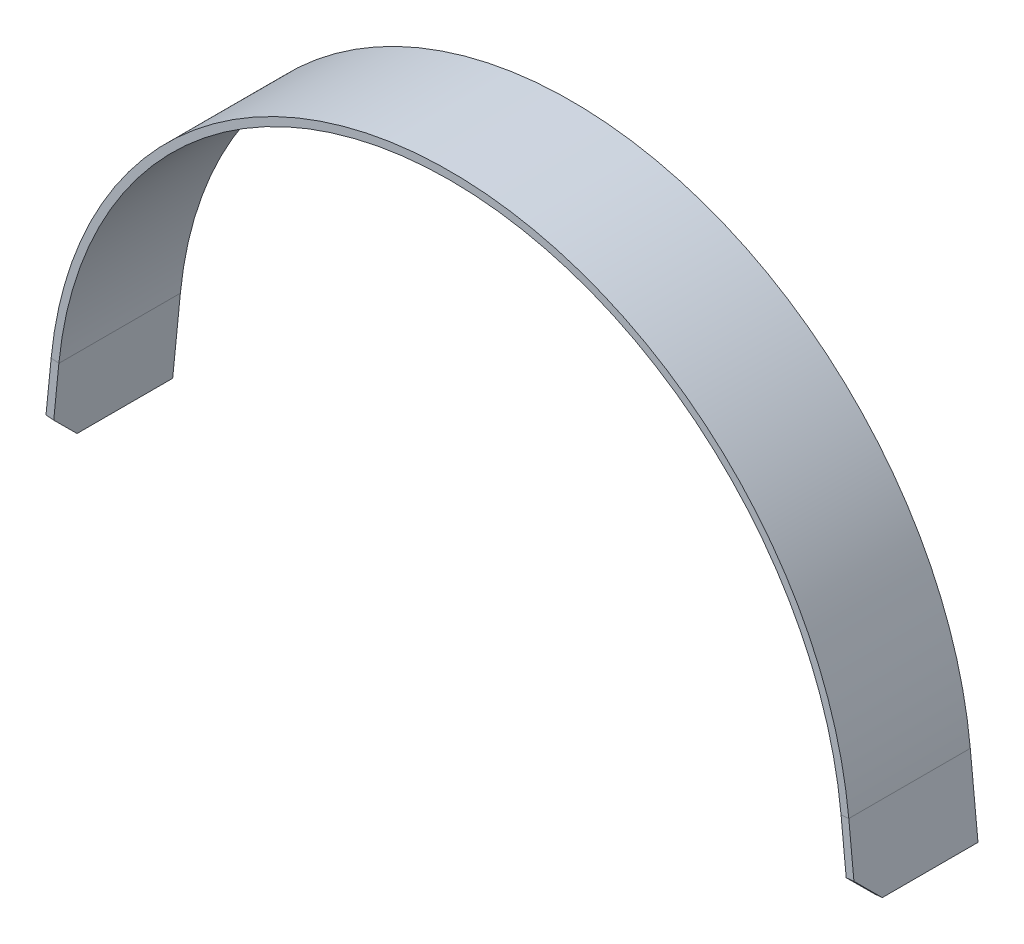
ISO-10303-21;
HEADER;
FILE_DESCRIPTION(('STEP AP214'),'2;1');
FILE_NAME('part.step','',(''),(''),'','','');
FILE_SCHEMA(('AUTOMOTIVE_DESIGN { 1 0 10303 214 1 1 1 1 }'));
ENDSEC;
DATA;
#1=APPLICATION_CONTEXT('core data for automotive mechanical design processes');
#2=APPLICATION_PROTOCOL_DEFINITION('international standard','automotive_design',2000,#1);
#3=PRODUCT_CONTEXT('',#1,'mechanical');
#4=PRODUCT('Part','Part','',(#3));
#5=PRODUCT_RELATED_PRODUCT_CATEGORY('part','',(#4));
#6=PRODUCT_DEFINITION_FORMATION('','',#4);
#7=PRODUCT_DEFINITION_CONTEXT('part definition',#1,'design');
#8=PRODUCT_DEFINITION('design','',#6,#7);
#9=PRODUCT_DEFINITION_SHAPE('','',#8);
#10=(LENGTH_UNIT() NAMED_UNIT(*) SI_UNIT(.MILLI.,.METRE.));
#11=(NAMED_UNIT(*) PLANE_ANGLE_UNIT() SI_UNIT($,.RADIAN.));
#12=(NAMED_UNIT(*) SI_UNIT($,.STERADIAN.) SOLID_ANGLE_UNIT());
#13=UNCERTAINTY_MEASURE_WITH_UNIT(LENGTH_MEASURE(1.E-05),#10,'distance_accuracy_value','');
#14=(GEOMETRIC_REPRESENTATION_CONTEXT(3) GLOBAL_UNCERTAINTY_ASSIGNED_CONTEXT((#13)) GLOBAL_UNIT_ASSIGNED_CONTEXT((#10,
#11,#12)) REPRESENTATION_CONTEXT('',''));
#15=CARTESIAN_POINT('',(0.,0.,0.));
#16=DIRECTION('',(0.,0.,1.));
#17=DIRECTION('',(1.,0.,0.));
#18=AXIS2_PLACEMENT_3D('',#15,#16,#17);
#19=CARTESIAN_POINT('',(-151.25805763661,15.,47.));
#20=DIRECTION('',(0.,0.,1.));
#21=DIRECTION('',(1.,0.,0.));
#22=AXIS2_PLACEMENT_3D('',#19,#20,#21);
#23=PLANE('',#22);
#24=DIRECTION('',(-0.995118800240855,0.0986842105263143,0.));
#25=VECTOR('',#24,1.);
#26=CARTESIAN_POINT('',(-151.25805763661,15.,47.));
#27=LINE('',#26,#25);
#28=CARTESIAN_POINT('',(-151.25805763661,15.,47.));
#29=VERTEX_POINT('',#28);
#30=CARTESIAN_POINT('',(-154.243414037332,15.2960526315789,47.));
#31=VERTEX_POINT('',#30);
#32=EDGE_CURVE('E121',#29,#31,#27,.T.);
#33=ORIENTED_EDGE('',*,*,#32,.F.);
#34=CARTESIAN_POINT('',(0.,0.,47.));
#35=DIRECTION('',(0.,0.,-1.));
#36=DIRECTION('',(-1.,0.,0.));
#37=AXIS2_PLACEMENT_3D('',#34,#35,#36);
#38=CIRCLE('',#37,152.);
#39=CARTESIAN_POINT('',(151.25805763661,15.,47.));
#40=VERTEX_POINT('',#39);
#41=EDGE_CURVE('E119',#29,#40,#38,.T.);
#42=ORIENTED_EDGE('',*,*,#41,.T.);
#43=DIRECTION('',(-0.995118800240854,-0.0986842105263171,0.));
#44=VECTOR('',#43,1.);
#45=CARTESIAN_POINT('',(154.243414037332,15.2960526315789,47.));
#46=LINE('',#45,#44);
#47=CARTESIAN_POINT('',(154.243414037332,15.2960526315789,47.));
#48=VERTEX_POINT('',#47);
#49=EDGE_CURVE('E113',#48,#40,#46,.T.);
#50=ORIENTED_EDGE('',*,*,#49,.F.);
#51=CARTESIAN_POINT('',(0.,0.,47.));
#52=DIRECTION('',(0.,0.,1.));
#53=DIRECTION('',(1.,0.,0.));
#54=AXIS2_PLACEMENT_3D('',#51,#52,#53);
#55=CIRCLE('',#54,155.);
#56=EDGE_CURVE('E117',#31,#48,#55,.F.);
#57=ORIENTED_EDGE('',*,*,#56,.F.);
#58=EDGE_LOOP('',(#33,#42,#50,#57));
#59=FACE_BOUND('',#58,.T.);
#60=ADVANCED_FACE('F36',(#59),#23,.T.);
#61=CARTESIAN_POINT('',(154.243414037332,15.2960526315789,47.));
#62=DIRECTION('',(0.,0.,1.));
#63=DIRECTION('',(1.,0.,0.));
#64=AXIS2_PLACEMENT_3D('',#61,#62,#63);
#65=PLANE('',#64);
#66=DIRECTION('',(0.0986842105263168,0.995118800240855,0.));
#67=VECTOR('',#66,1.);
#68=CARTESIAN_POINT('',(-154.243414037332,15.296052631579,47.));
#69=LINE('',#68,#67);
#70=CARTESIAN_POINT('',(-156.231620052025,-4.75275936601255,47.));
#71=VERTEX_POINT('',#70);
#72=EDGE_CURVE('E145',#71,#31,#69,.T.);
#73=ORIENTED_EDGE('',*,*,#72,.F.);
#74=DIRECTION('',(0.995118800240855,-0.0986842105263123,0.));
#75=VECTOR('',#74,1.);
#76=CARTESIAN_POINT('',(149.25098640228,-35.0469411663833,47.));
#77=LINE('',#76,#75);
#78=CARTESIAN_POINT('',(-153.246263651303,-5.04881199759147,47.));
#79=VERTEX_POINT('',#78);
#80=EDGE_CURVE('E198',#71,#79,#77,.T.);
#81=ORIENTED_EDGE('',*,*,#80,.T.);
#82=DIRECTION('',(0.0986842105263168,0.995118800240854,0.));
#83=VECTOR('',#82,1.);
#84=CARTESIAN_POINT('',(-151.25805763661,15.,47.));
#85=LINE('',#84,#83);
#86=EDGE_CURVE('E147',#79,#29,#85,.T.);
#87=ORIENTED_EDGE('',*,*,#86,.T.);
#88=ORIENTED_EDGE('',*,*,#32,.T.);
#89=EDGE_LOOP('',(#73,#81,#87,#88));
#90=FACE_BOUND('',#89,.T.);
#91=ADVANCED_FACE('F240',(#90),#65,.T.);
#92=CARTESIAN_POINT('',(151.25805763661,15.,0.));
#93=DIRECTION('',(0.,0.,-1.));
#94=DIRECTION('',(-1.,0.,0.));
#95=AXIS2_PLACEMENT_3D('',#92,#93,#94);
#96=PLANE('',#95);
#97=DIRECTION('',(0.995118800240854,0.0986842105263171,0.));
#98=VECTOR('',#97,1.);
#99=CARTESIAN_POINT('',(151.25805763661,15.,0.));
#100=LINE('',#99,#98);
#101=CARTESIAN_POINT('',(151.25805763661,15.,0.));
#102=VERTEX_POINT('',#101);
#103=CARTESIAN_POINT('',(154.243414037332,15.2960526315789,0.));
#104=VERTEX_POINT('',#103);
#105=EDGE_CURVE('E122',#102,#104,#100,.T.);
#106=ORIENTED_EDGE('',*,*,#105,.F.);
#107=CARTESIAN_POINT('',(0.,0.,0.));
#108=DIRECTION('',(0.,0.,-1.));
#109=DIRECTION('',(-1.,0.,0.));
#110=AXIS2_PLACEMENT_3D('',#107,#108,#109);
#111=CIRCLE('',#110,152.);
#112=CARTESIAN_POINT('',(-151.25805763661,15.,0.));
#113=VERTEX_POINT('',#112);
#114=EDGE_CURVE('E172',#113,#102,#111,.T.);
#115=ORIENTED_EDGE('',*,*,#114,.F.);
#116=DIRECTION('',(0.995118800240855,-0.0986842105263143,0.));
#117=VECTOR('',#116,1.);
#118=CARTESIAN_POINT('',(-154.243414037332,15.2960526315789,0.));
#119=LINE('',#118,#117);
#120=CARTESIAN_POINT('',(-154.243414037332,15.2960526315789,0.));
#121=VERTEX_POINT('',#120);
#122=EDGE_CURVE('E188',#121,#113,#119,.T.);
#123=ORIENTED_EDGE('',*,*,#122,.F.);
#124=CARTESIAN_POINT('',(0.,0.,0.));
#125=DIRECTION('',(0.,0.,1.));
#126=DIRECTION('',(1.,0.,0.));
#127=AXIS2_PLACEMENT_3D('',#124,#125,#126);
#128=CIRCLE('',#127,155.);
#129=EDGE_CURVE('E161',#121,#104,#128,.F.);
#130=ORIENTED_EDGE('',*,*,#129,.T.);
#131=EDGE_LOOP('',(#106,#115,#123,#130));
#132=FACE_BOUND('',#131,.T.);
#133=ADVANCED_FACE('F217',(#132),#96,.T.);
#134=CARTESIAN_POINT('',(-154.243414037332,15.2960526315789,0.));
#135=DIRECTION('',(0.,0.,-1.));
#136=DIRECTION('',(-1.,0.,0.));
#137=AXIS2_PLACEMENT_3D('',#134,#135,#136);
#138=PLANE('',#137);
#139=DIRECTION('',(0.0986842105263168,-0.995118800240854,0.));
#140=VECTOR('',#139,1.);
#141=CARTESIAN_POINT('',(151.25805763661,15.,0.));
#142=LINE('',#141,#140);
#143=CARTESIAN_POINT('',(154.233105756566,-15.,0.));
#144=VERTEX_POINT('',#143);
#145=EDGE_CURVE('E154',#102,#144,#142,.T.);
#146=ORIENTED_EDGE('',*,*,#145,.F.);
#147=ORIENTED_EDGE('',*,*,#105,.T.);
#148=DIRECTION('',(0.0986842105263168,-0.995118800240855,0.));
#149=VECTOR('',#148,1.);
#150=CARTESIAN_POINT('',(154.243414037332,15.296052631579,0.));
#151=LINE('',#150,#149);
#152=CARTESIAN_POINT('',(157.218462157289,-14.7039473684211,0.));
#153=VERTEX_POINT('',#152);
#154=EDGE_CURVE('E132',#104,#153,#151,.T.);
#155=ORIENTED_EDGE('',*,*,#154,.T.);
#156=DIRECTION('',(-0.995118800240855,-0.0986842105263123,0.));
#157=VECTOR('',#156,1.);
#158=CARTESIAN_POINT('',(157.218462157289,-14.7039473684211,0.));
#159=LINE('',#158,#157);
#160=EDGE_CURVE('E157',#153,#144,#159,.T.);
#161=ORIENTED_EDGE('',*,*,#160,.T.);
#162=EDGE_LOOP('',(#146,#147,#155,#161));
#163=FACE_BOUND('',#162,.T.);
#164=ADVANCED_FACE('F214',(#163),#138,.T.);
#165=CARTESIAN_POINT('',(151.25805763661,15.,47.));
#166=DIRECTION('',(0.995118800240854,0.0986842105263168,0.));
#167=DIRECTION('',(-0.0986842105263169,0.995118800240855,0.));
#168=AXIS2_PLACEMENT_3D('',#165,#166,#167);
#169=PLANE('',#168);
#170=DIRECTION('',(0.,0.,-1.));
#171=VECTOR('',#170,1.);
#172=CARTESIAN_POINT('',(154.233105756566,-15.,47.));
#173=LINE('',#172,#171);
#174=CARTESIAN_POINT('',(154.233105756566,-15.,37.0000000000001));
#175=VERTEX_POINT('',#174);
#176=EDGE_CURVE('E186',#175,#144,#173,.T.);
#177=ORIENTED_EDGE('',*,*,#176,.F.);
#178=DIRECTION('',(0.0697802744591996,-0.70365525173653,-0.707106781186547));
#179=VECTOR('',#178,1.);
#180=CARTESIAN_POINT('',(154.233105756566,-15.,37.0000000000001));
#181=LINE('',#180,#179);
#182=CARTESIAN_POINT('',(153.246263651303,-5.04881199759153,47.));
#183=VERTEX_POINT('',#182);
#184=EDGE_CURVE('E58',#175,#183,#181,.F.);
#185=ORIENTED_EDGE('',*,*,#184,.T.);
#186=DIRECTION('',(0.0986842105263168,-0.995118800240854,0.));
#187=VECTOR('',#186,1.);
#188=CARTESIAN_POINT('',(151.25805763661,15.,47.));
#189=LINE('',#188,#187);
#190=EDGE_CURVE('E140',#40,#183,#189,.T.);
#191=ORIENTED_EDGE('',*,*,#190,.F.);
#192=DIRECTION('',(0.,0.,-1.));
#193=VECTOR('',#192,1.);
#194=CARTESIAN_POINT('',(151.25805763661,15.,47.));
#195=LINE('',#194,#193);
#196=EDGE_CURVE('E153',#40,#102,#195,.T.);
#197=ORIENTED_EDGE('',*,*,#196,.T.);
#198=ORIENTED_EDGE('',*,*,#145,.T.);
#199=EDGE_LOOP('',(#177,#185,#191,#197,#198));
#200=FACE_BOUND('',#199,.T.);
#201=ADVANCED_FACE('F211',(#200),#169,.F.);
#202=CARTESIAN_POINT('',(157.218462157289,-14.7039473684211,47.));
#203=DIRECTION('',(0.0986842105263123,-0.995118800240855,0.));
#204=DIRECTION('',(0.995118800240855,0.0986842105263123,0.));
#205=AXIS2_PLACEMENT_3D('',#202,#203,#204);
#206=PLANE('',#205);
#207=DIRECTION('',(0.,0.,-1.));
#208=VECTOR('',#207,1.);
#209=CARTESIAN_POINT('',(157.218462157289,-14.7039473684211,47.));
#210=LINE('',#209,#208);
#211=CARTESIAN_POINT('',(157.218462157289,-14.7039473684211,37.0000000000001));
#212=VERTEX_POINT('',#211);
#213=EDGE_CURVE('E136',#212,#153,#210,.T.);
#214=ORIENTED_EDGE('',*,*,#213,.F.);
#215=DIRECTION('',(-0.995118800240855,-0.0986842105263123,0.));
#216=VECTOR('',#215,1.);
#217=CARTESIAN_POINT('',(157.218462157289,-14.7039473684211,37.0000000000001));
#218=LINE('',#217,#216);
#219=EDGE_CURVE('E202',#212,#175,#218,.T.);
#220=ORIENTED_EDGE('',*,*,#219,.T.);
#221=ORIENTED_EDGE('',*,*,#176,.T.);
#222=ORIENTED_EDGE('',*,*,#160,.F.);
#223=EDGE_LOOP('',(#214,#220,#221,#222));
#224=FACE_BOUND('',#223,.T.);
#225=ADVANCED_FACE('F208',(#224),#206,.T.);
#226=CARTESIAN_POINT('',(154.243414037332,15.296052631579,47.));
#227=DIRECTION('',(0.995118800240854,0.0986842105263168,0.));
#228=DIRECTION('',(-0.0986842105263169,0.995118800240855,0.));
#229=AXIS2_PLACEMENT_3D('',#226,#227,#228);
#230=PLANE('',#229);
#231=DIRECTION('',(0.0986842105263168,-0.995118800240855,0.));
#232=VECTOR('',#231,1.);
#233=CARTESIAN_POINT('',(154.243414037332,15.296052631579,47.));
#234=LINE('',#233,#232);
#235=CARTESIAN_POINT('',(156.231620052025,-4.7527593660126,47.));
#236=VERTEX_POINT('',#235);
#237=EDGE_CURVE('E129',#48,#236,#234,.T.);
#238=ORIENTED_EDGE('',*,*,#237,.T.);
#239=DIRECTION('',(-0.0697802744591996,0.70365525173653,0.707106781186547));
#240=VECTOR('',#239,1.);
#241=CARTESIAN_POINT('',(155.237517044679,5.2716466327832,57.0735771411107));
#242=LINE('',#241,#240);
#243=EDGE_CURVE('E11',#236,#212,#242,.F.);
#244=ORIENTED_EDGE('',*,*,#243,.T.);
#245=ORIENTED_EDGE('',*,*,#213,.T.);
#246=ORIENTED_EDGE('',*,*,#154,.F.);
#247=DIRECTION('',(0.,0.,-1.));
#248=VECTOR('',#247,1.);
#249=CARTESIAN_POINT('',(154.243414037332,15.2960526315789,47.));
#250=LINE('',#249,#248);
#251=EDGE_CURVE('E127',#48,#104,#250,.T.);
#252=ORIENTED_EDGE('',*,*,#251,.F.);
#253=EDGE_LOOP('',(#238,#244,#245,#246,#252));
#254=FACE_BOUND('',#253,.T.);
#255=ADVANCED_FACE('F128',(#254),#230,.T.);
#256=CARTESIAN_POINT('',(0.,0.,47.));
#257=DIRECTION('',(0.,0.,-1.));
#258=DIRECTION('',(-1.,0.,0.));
#259=AXIS2_PLACEMENT_3D('',#256,#257,#258);
#260=CYLINDRICAL_SURFACE('',#259,155.);
#261=ORIENTED_EDGE('',*,*,#129,.F.);
#262=DIRECTION('',(0.,0.,-1.));
#263=VECTOR('',#262,1.);
#264=CARTESIAN_POINT('',(-154.243414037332,15.2960526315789,47.));
#265=LINE('',#264,#263);
#266=EDGE_CURVE('E137',#31,#121,#265,.T.);
#267=ORIENTED_EDGE('',*,*,#266,.F.);
#268=ORIENTED_EDGE('',*,*,#56,.T.);
#269=ORIENTED_EDGE('',*,*,#251,.T.);
#270=EDGE_LOOP('',(#261,#267,#268,#269));
#271=FACE_BOUND('',#270,.T.);
#272=ADVANCED_FACE('F143',(#271),#260,.T.);
#273=CARTESIAN_POINT('',(-154.243414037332,15.296052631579,47.));
#274=DIRECTION('',(-0.995118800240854,0.0986842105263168,0.));
#275=DIRECTION('',(-0.0986842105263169,-0.995118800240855,0.));
#276=AXIS2_PLACEMENT_3D('',#273,#274,#275);
#277=PLANE('',#276);
#278=DIRECTION('',(0.,0.,-1.));
#279=VECTOR('',#278,1.);
#280=CARTESIAN_POINT('',(-157.218462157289,-14.7039473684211,47.));
#281=LINE('',#280,#279);
#282=CARTESIAN_POINT('',(-157.218462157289,-14.7039473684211,37.));
#283=VERTEX_POINT('',#282);
#284=CARTESIAN_POINT('',(-157.218462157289,-14.7039473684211,0.));
#285=VERTEX_POINT('',#284);
#286=EDGE_CURVE('E182',#283,#285,#281,.T.);
#287=ORIENTED_EDGE('',*,*,#286,.F.);
#288=DIRECTION('',(-0.0697802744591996,-0.703655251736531,-0.707106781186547));
#289=VECTOR('',#288,1.);
#290=CARTESIAN_POINT('',(-155.237517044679,5.27164663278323,57.0735771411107));
#291=LINE('',#290,#289);
#292=EDGE_CURVE('E196',#283,#71,#291,.F.);
#293=ORIENTED_EDGE('',*,*,#292,.T.);
#294=ORIENTED_EDGE('',*,*,#72,.T.);
#295=ORIENTED_EDGE('',*,*,#266,.T.);
#296=DIRECTION('',(0.0986842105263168,0.995118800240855,0.));
#297=VECTOR('',#296,1.);
#298=CARTESIAN_POINT('',(-154.243414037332,15.296052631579,0.));
#299=LINE('',#298,#297);
#300=EDGE_CURVE('E163',#285,#121,#299,.T.);
#301=ORIENTED_EDGE('',*,*,#300,.F.);
#302=EDGE_LOOP('',(#287,#293,#294,#295,#301));
#303=FACE_BOUND('',#302,.T.);
#304=ADVANCED_FACE('F236',(#303),#277,.T.);
#305=CARTESIAN_POINT('',(-154.233105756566,-15.,47.));
#306=DIRECTION('',(-0.0986842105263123,-0.995118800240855,0.));
#307=DIRECTION('',(0.995118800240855,-0.0986842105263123,0.));
#308=AXIS2_PLACEMENT_3D('',#305,#306,#307);
#309=PLANE('',#308);
#310=DIRECTION('',(0.,0.,-1.));
#311=VECTOR('',#310,1.);
#312=CARTESIAN_POINT('',(-154.233105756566,-15.,47.));
#313=LINE('',#312,#311);
#314=CARTESIAN_POINT('',(-154.233105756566,-15.,37.));
#315=VERTEX_POINT('',#314);
#316=CARTESIAN_POINT('',(-154.233105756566,-15.,0.));
#317=VERTEX_POINT('',#316);
#318=EDGE_CURVE('E180',#315,#317,#313,.T.);
#319=ORIENTED_EDGE('',*,*,#318,.F.);
#320=DIRECTION('',(-0.995118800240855,0.0986842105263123,0.));
#321=VECTOR('',#320,1.);
#322=CARTESIAN_POINT('',(-154.233105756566,-15.,37.));
#323=LINE('',#322,#321);
#324=EDGE_CURVE('E193',#315,#283,#323,.T.);
#325=ORIENTED_EDGE('',*,*,#324,.T.);
#326=ORIENTED_EDGE('',*,*,#286,.T.);
#327=DIRECTION('',(-0.995118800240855,0.0986842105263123,0.));
#328=VECTOR('',#327,1.);
#329=CARTESIAN_POINT('',(-154.233105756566,-15.,0.));
#330=LINE('',#329,#328);
#331=EDGE_CURVE('E166',#317,#285,#330,.T.);
#332=ORIENTED_EDGE('',*,*,#331,.F.);
#333=EDGE_LOOP('',(#319,#325,#326,#332));
#334=FACE_BOUND('',#333,.T.);
#335=ADVANCED_FACE('F231',(#334),#309,.T.);
#336=CARTESIAN_POINT('',(-151.25805763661,15.,47.));
#337=DIRECTION('',(-0.995118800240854,0.0986842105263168,0.));
#338=DIRECTION('',(-0.0986842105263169,-0.995118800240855,0.));
#339=AXIS2_PLACEMENT_3D('',#336,#337,#338);
#340=PLANE('',#339);
#341=ORIENTED_EDGE('',*,*,#86,.F.);
#342=DIRECTION('',(0.0697802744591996,0.703655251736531,0.707106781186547));
#343=VECTOR('',#342,1.);
#344=CARTESIAN_POINT('',(-154.233105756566,-15.,37.));
#345=LINE('',#344,#343);
#346=EDGE_CURVE('E200',#79,#315,#345,.F.);
#347=ORIENTED_EDGE('',*,*,#346,.T.);
#348=ORIENTED_EDGE('',*,*,#318,.T.);
#349=DIRECTION('',(0.0986842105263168,0.995118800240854,0.));
#350=VECTOR('',#349,1.);
#351=CARTESIAN_POINT('',(-151.25805763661,15.,0.));
#352=LINE('',#351,#350);
#353=EDGE_CURVE('E169',#317,#113,#352,.T.);
#354=ORIENTED_EDGE('',*,*,#353,.T.);
#355=DIRECTION('',(0.,0.,-1.));
#356=VECTOR('',#355,1.);
#357=CARTESIAN_POINT('',(-151.25805763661,15.,47.));
#358=LINE('',#357,#356);
#359=EDGE_CURVE('E177',#29,#113,#358,.T.);
#360=ORIENTED_EDGE('',*,*,#359,.F.);
#361=EDGE_LOOP('',(#341,#347,#348,#354,#360));
#362=FACE_BOUND('',#361,.T.);
#363=ADVANCED_FACE('F223',(#362),#340,.F.);
#364=CARTESIAN_POINT('',(0.,0.,47.));
#365=DIRECTION('',(0.,0.,-1.));
#366=DIRECTION('',(-1.,0.,0.));
#367=AXIS2_PLACEMENT_3D('',#364,#365,#366);
#368=CYLINDRICAL_SURFACE('',#367,152.);
#369=ORIENTED_EDGE('',*,*,#114,.T.);
#370=ORIENTED_EDGE('',*,*,#196,.F.);
#371=ORIENTED_EDGE('',*,*,#41,.F.);
#372=ORIENTED_EDGE('',*,*,#359,.T.);
#373=EDGE_LOOP('',(#369,#370,#371,#372));
#374=FACE_BOUND('',#373,.T.);
#375=ADVANCED_FACE('F219',(#374),#368,.F.);
#376=CARTESIAN_POINT('',(0.,0.,47.));
#377=DIRECTION('',(0.,0.,1.));
#378=DIRECTION('',(1.,0.,0.));
#379=AXIS2_PLACEMENT_3D('',#376,#377,#378);
#380=PLANE('',#379);
#381=ORIENTED_EDGE('',*,*,#190,.T.);
#382=DIRECTION('',(0.995118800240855,0.0986842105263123,0.));
#383=VECTOR('',#382,1.);
#384=CARTESIAN_POINT('',(1.98820601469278,-20.048811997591,47.));
#385=LINE('',#384,#383);
#386=EDGE_CURVE('E44',#183,#236,#385,.T.);
#387=ORIENTED_EDGE('',*,*,#386,.T.);
#388=ORIENTED_EDGE('',*,*,#237,.F.);
#389=ORIENTED_EDGE('',*,*,#49,.T.);
#390=EDGE_LOOP('',(#381,#387,#388,#389));
#391=FACE_BOUND('',#390,.T.);
#392=ADVANCED_FACE('F139',(#391),#380,.T.);
#393=CARTESIAN_POINT('',(0.,0.,0.));
#394=DIRECTION('',(0.,0.,1.));
#395=DIRECTION('',(1.,0.,0.));
#396=AXIS2_PLACEMENT_3D('',#393,#394,#395);
#397=PLANE('',#396);
#398=ORIENTED_EDGE('',*,*,#300,.T.);
#399=ORIENTED_EDGE('',*,*,#122,.T.);
#400=ORIENTED_EDGE('',*,*,#353,.F.);
#401=ORIENTED_EDGE('',*,*,#331,.T.);
#402=EDGE_LOOP('',(#398,#399,#400,#401));
#403=FACE_BOUND('',#402,.T.);
#404=ADVANCED_FACE('F229',(#403),#397,.F.);
#405=CARTESIAN_POINT('',(-154.233105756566,-15.,37.));
#406=DIRECTION('',(0.0697802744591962,0.703655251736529,-0.707106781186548));
#407=DIRECTION('',(0.,0.708834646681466,0.705374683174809));
#408=AXIS2_PLACEMENT_3D('',#405,#406,#407);
#409=PLANE('',#408);
#410=ORIENTED_EDGE('',*,*,#346,.F.);
#411=ORIENTED_EDGE('',*,*,#80,.F.);
#412=ORIENTED_EDGE('',*,*,#292,.F.);
#413=ORIENTED_EDGE('',*,*,#324,.F.);
#414=EDGE_LOOP('',(#410,#411,#412,#413));
#415=FACE_BOUND('',#414,.T.);
#416=ADVANCED_FACE('F242',(#415),#409,.F.);
#417=CARTESIAN_POINT('',(157.218462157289,-14.7039473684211,37.0000000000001));
#418=DIRECTION('',(-0.0697802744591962,0.703655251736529,-0.707106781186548));
#419=DIRECTION('',(0.,0.708834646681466,0.705374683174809));
#420=AXIS2_PLACEMENT_3D('',#417,#418,#419);
#421=PLANE('',#420);
#422=ORIENTED_EDGE('',*,*,#243,.F.);
#423=ORIENTED_EDGE('',*,*,#386,.F.);
#424=ORIENTED_EDGE('',*,*,#184,.F.);
#425=ORIENTED_EDGE('',*,*,#219,.F.);
#426=EDGE_LOOP('',(#422,#423,#424,#425));
#427=FACE_BOUND('',#426,.T.);
#428=ADVANCED_FACE('F38',(#427),#421,.F.);
#429=CLOSED_SHELL('',(#60,#91,#133,#164,#201,#225,#255,#272,#304,#335,#363,#375,#392,#404,#416,#428));
#430=MANIFOLD_SOLID_BREP('B2',#429);
#431=ADVANCED_BREP_SHAPE_REPRESENTATION('',(#18,#430),#14);
#432=SHAPE_DEFINITION_REPRESENTATION(#9,#431);
ENDSEC;
END-ISO-10303-21;
